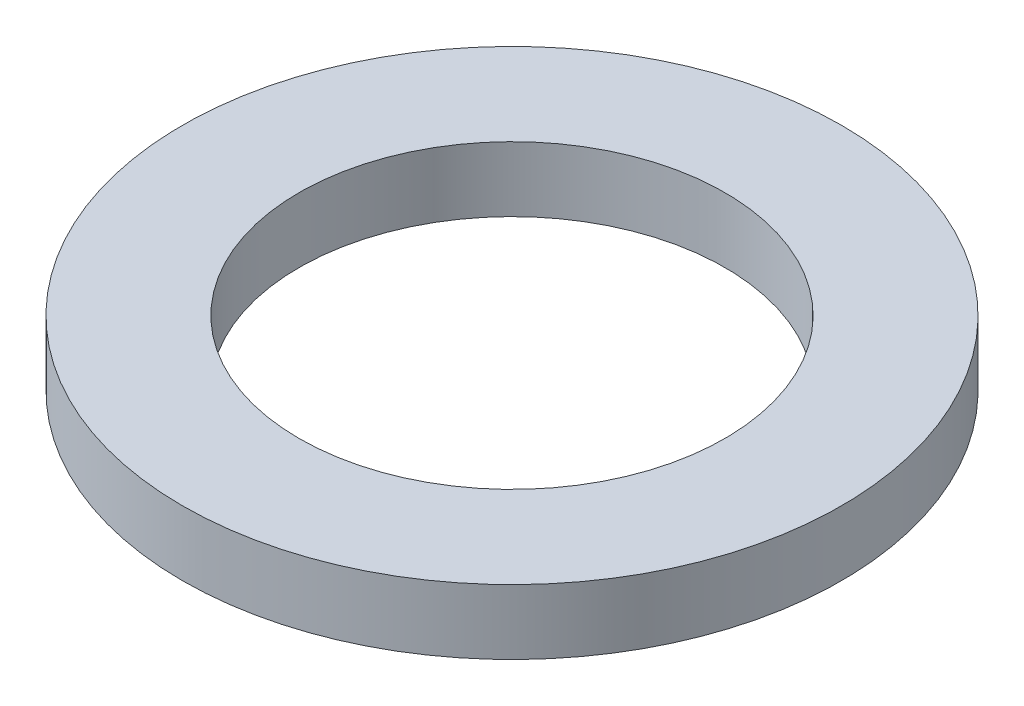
from build123d import *

# Parameters (mm, degrees)
SKETCH1_R          = 20.6375
SKETCH1_R_2        = 13.335
BASE_EXTRUDE_DEPTH = 4.064


with BuildPart() as part:
    # Sketch1 → Base-Extrude (new body)
    with BuildSketch(Plane(origin=(0, 0, 0), x_dir=(1, 0, 0), z_dir=(0, 1, 0))):
        with Locations(Location((0, 0, 0), (0, 0, 270))):
            Circle(SKETCH1_R)
        with Locations(Location((0, 0, 0), (0, 0, 270))):
            Circle(SKETCH1_R_2, mode=Mode.SUBTRACT)
    extrude(amount=BASE_EXTRUDE_DEPTH)


solid = part.part
